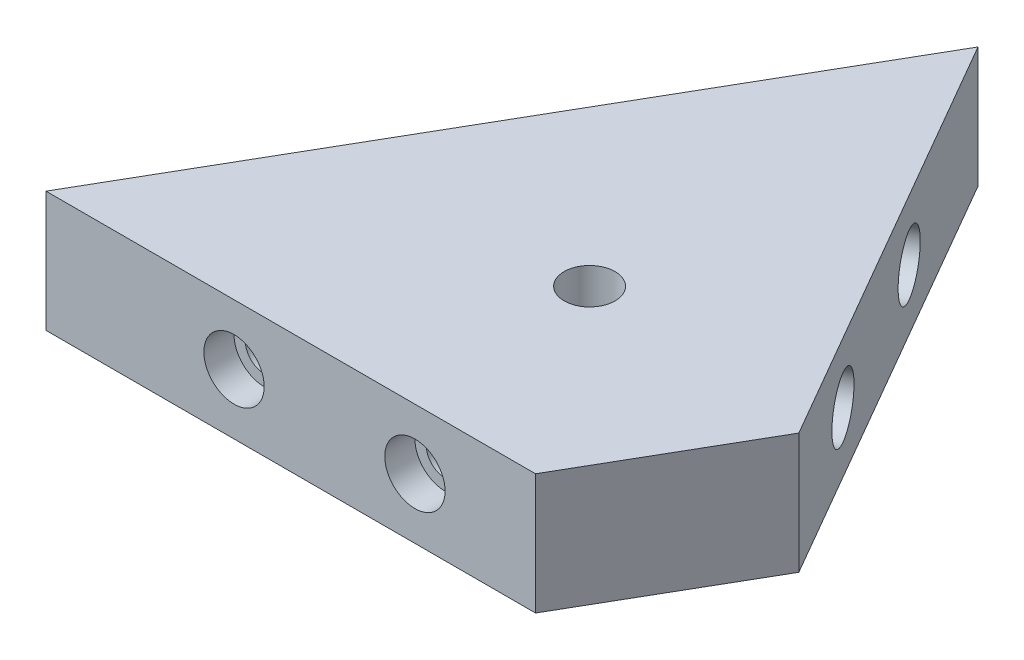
from build123d import *

# Parameters (mm, degrees)
BOSS_EXTRUDE1_DEPTH         = 25.4
SKETCH2_R                   = 6.35
CUT_EXTRUDE1_DEPTH          = 6.35
F_3_8_16_TAPPED_HOLE1_D     = 7.9375
F_3_8_16_TAPPED_HOLE1_DEPTH = 15.875
F_3_8_16_TAPPED_HOLE1_TIP   = 2.384665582
F_1_2_13_TAPPED_HOLE1_D     = 10.71626
F_3_8_16_TAPPED_HOLE2_D     = 7.9375
F_3_8_16_TAPPED_HOLE2_DEPTH = 15.875
F_3_8_16_TAPPED_HOLE2_TIP   = 2.384665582


with BuildPart() as part:
    # Sketch1 → Boss-Extrude1 (new body)
    with BuildSketch(Plane(origin=(0, 0, 0), x_dir=(1, 0, 0), z_dir=(0, 1, 0))):
        Polygon((119.068292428, -241.162389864), (129.21607637, -223.585912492), (51.895065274, -178.944605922), (15.973610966, -241.162389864), align=None)
    boss_extrude1 = extrude(amount=BOSS_EXTRUDE1_DEPTH)

    # Sketch2 → Cut-Extrude1 (cut)
    with BuildSketch(Plane.XY.offset(241.162389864)):
        with Locations((55.568292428, 12.7)):
            Circle(SKETCH2_R)
        with Locations((93.668292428, 12.7)):
            Circle(SKETCH2_R)
    cut_extrude1 = extrude(amount=-CUT_EXTRUDE1_DEPTH, mode=Mode.SUBTRACT)

    # 3_8-16 Tapped Hole1
    with Locations(Plane.XY.offset(234.812389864)):
        with Locations((93.668292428, 12.7), (55.568292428, 12.7)):
            Hole(F_3_8_16_TAPPED_HOLE1_D / 2, depth=F_3_8_16_TAPPED_HOLE1_DEPTH)
            with Locations((0, 0, -(F_3_8_16_TAPPED_HOLE1_DEPTH + F_3_8_16_TAPPED_HOLE1_TIP / 2))):  # 118° drill point
                Cone(0, F_3_8_16_TAPPED_HOLE1_D / 2, F_3_8_16_TAPPED_HOLE1_TIP, mode=Mode.SUBTRACT)

    # Mirror1: Boss-Extrude1, Cut-Extrude1 across plane
    add(boss_extrude1.mirror(Plane(origin=(51.895065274, 25.4, 178.944605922), x_dir=(0.8660254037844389, 0, 0.4999999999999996), z_dir=(-0.49999999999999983, 0, 0.8660254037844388))))
    add(cut_extrude1.mirror(Plane(origin=(51.895065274, 25.4, 178.944605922), x_dir=(0.8660254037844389, 0, 0.4999999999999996), z_dir=(-0.49999999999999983, 0, 0.8660254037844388))), mode=Mode.SUBTRACT)

    # 1_2-13 Tapped Hole1 (through all)
    with Locations(Plane(origin=(0, 25.4, 0), x_dir=(1, 0, 0), z_dir=(0, 1, 0))):
        with Locations((90.555570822, -201.265259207)):
            Hole(F_1_2_13_TAPPED_HOLE1_D / 2)

    # 3_8-16 Tapped Hole2
    with Locations(Plane(origin=(9.818931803, 0, -5.66896292), x_dir=(-0.5000000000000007, 0, -0.8660254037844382), z_dir=(0.8660254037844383, 0, -0.5000000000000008))):
        with Locations((-184.59133439, 12.7), (-222.69133439, 12.7)):
            Hole(F_3_8_16_TAPPED_HOLE2_D / 2, depth=F_3_8_16_TAPPED_HOLE2_DEPTH)
            with Locations((0, 0, -(F_3_8_16_TAPPED_HOLE2_DEPTH + F_3_8_16_TAPPED_HOLE2_TIP / 2))):  # 118° drill point
                Cone(0, F_3_8_16_TAPPED_HOLE2_D / 2, F_3_8_16_TAPPED_HOLE2_TIP, mode=Mode.SUBTRACT)


solid = part.part
